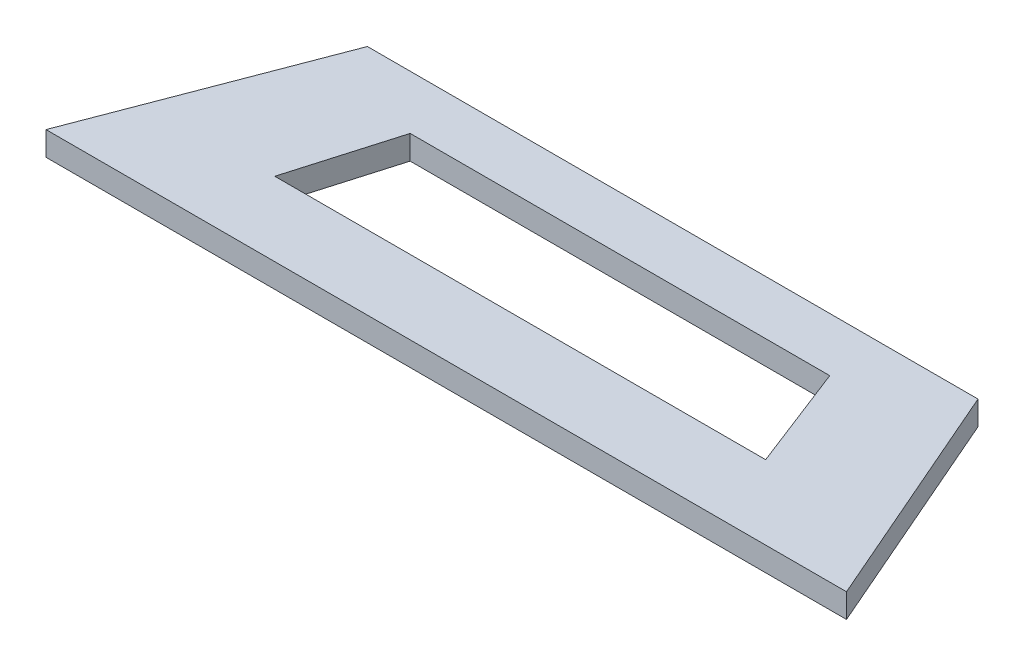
from build123d import *

# Parameters (mm, degrees)
BOSS_EXTRU_1_DEPTH      = 3
ENL_V_MAT_EXTRU_1_REACH = 106.181


with BuildPart() as part:
    # Esquisse1 → Boss.-Extru.1 (new body)
    with BuildSketch(Plane(origin=(0, 0, 0), x_dir=(1, 0, 0), z_dir=(0, 1, 0))):
        Polygon((0, 0), (100, 0), (87.364052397, 29.062679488), (11.088877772, 29.062679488), align=None)
    extrude(amount=BOSS_EXTRU_1_DEPTH)

    # Esquisse2 → Enl_v. mat.-Extru.1 (cut, up to next)
    with BuildSketch(Plane(origin=(0, 3, 0), x_dir=(1, 0, 0), z_dir=(0, 1, 0)), mode=Mode.PRIVATE) as enl_v_mat_extru_1_sk1:
        Polygon((19.339403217, 9.239386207), (60.911244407, 9.239386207), (80.660596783, 9.239386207), (75.574694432, 22.332879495), (23.158338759, 22.332879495), align=None)
    enl_v_mat_extru_1_tool1 = extrude(enl_v_mat_extru_1_sk1.sketch, amount=-ENL_V_MAT_EXTRU_1_REACH, mode=Mode.PRIVATE) & part.part
    add(enl_v_mat_extru_1_tool1.solids().sort_by_distance((49.691525, 3, -15.615278))[0], mode=Mode.SUBTRACT)


solid = part.part
